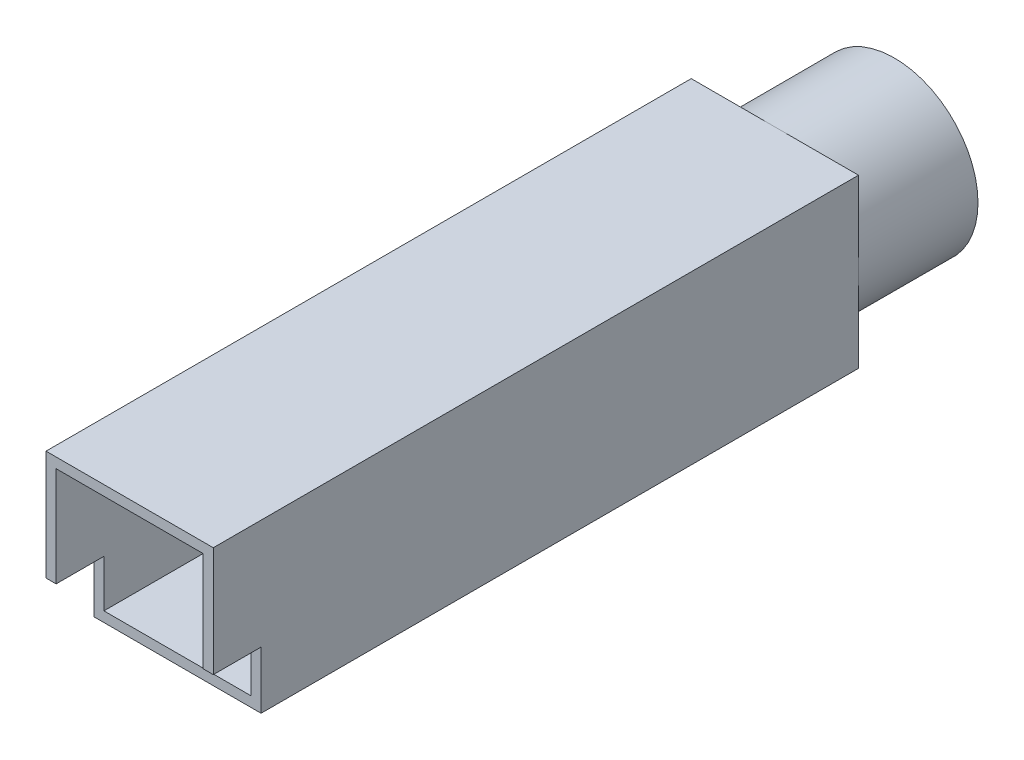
from build123d import *

# Parameters (mm, degrees)
SKETCH2_R           = 17.5
SKETCH2_R_2         = 16
BOSS_EXTRUDE1_DEPTH = 25
SKETCH3_W           = 35
SKETCH3_H           = 35
SKETCH3_W_2         = 30.765071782
SKETCH3_H_2         = 30.765071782
BOSS_EXTRUDE2_DEPTH = 135
SKETCH4_W           = 30.765071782
SKETCH4_H           = 30.765071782
SKETCH4_W_2         = 17.296778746
SKETCH4_H_2         = 17.296778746
BOSS_EXTRUDE3_DEPTH = 1
SKETCH6_W           = 35
SKETCH6_H           = 10
CUT_EXTRUDE1_DEPTH  = 12


with BuildPart() as part:
    # Sketch2 → Boss-Extrude1 (new body)
    with BuildSketch(Plane.XY):
        Circle(SKETCH2_R)
        Circle(SKETCH2_R_2, mode=Mode.SUBTRACT)
    extrude(amount=BOSS_EXTRUDE1_DEPTH)

    # Sketch3 → Boss-Extrude2 (add)
    with BuildSketch(Plane.XY.offset(25)):
        Rectangle(SKETCH3_W, SKETCH3_H)
        Rectangle(SKETCH3_W_2, SKETCH3_H_2, mode=Mode.SUBTRACT)
    extrude(amount=BOSS_EXTRUDE2_DEPTH)

    # Sketch4 → Boss-Extrude3 (add)
    with BuildSketch(Plane.XY.offset(25)):
        Rectangle(SKETCH4_W, SKETCH4_H)
        Rectangle(SKETCH4_W_2, SKETCH4_H_2, mode=Mode.SUBTRACT)
    extrude(amount=BOSS_EXTRUDE3_DEPTH)

    # Sketch6 → Cut-Extrude1 (cut)
    with BuildSketch(Plane.XZ.offset(17.5)):
        with Locations((0, 155)):
            Rectangle(SKETCH6_W, SKETCH6_H)
    extrude(amount=-CUT_EXTRUDE1_DEPTH, mode=Mode.SUBTRACT)


solid = part.part
